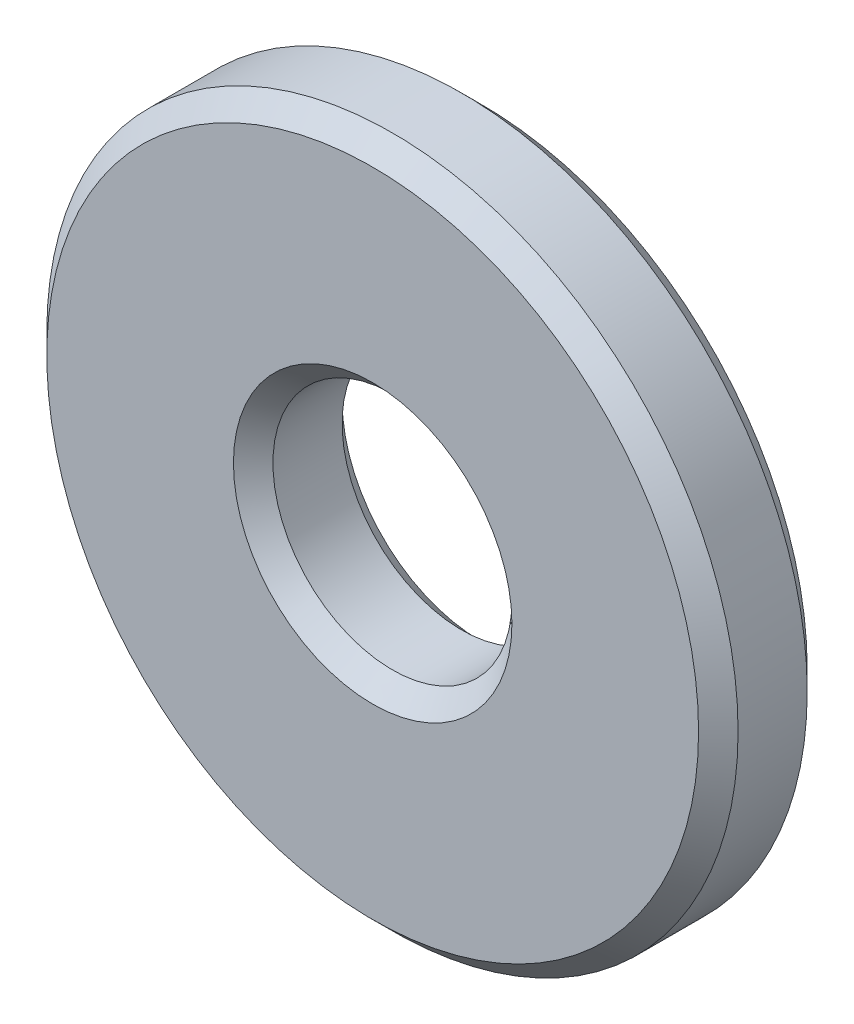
ISO-10303-21;
HEADER;
FILE_DESCRIPTION(('STEP AP214'),'2;1');
FILE_NAME('part.step','',(''),(''),'','','');
FILE_SCHEMA(('AUTOMOTIVE_DESIGN { 1 0 10303 214 1 1 1 1 }'));
ENDSEC;
DATA;
#1=APPLICATION_CONTEXT('core data for automotive mechanical design processes');
#2=APPLICATION_PROTOCOL_DEFINITION('international standard','automotive_design',2000,#1);
#3=PRODUCT_CONTEXT('',#1,'mechanical');
#4=PRODUCT('Part','Part','',(#3));
#5=PRODUCT_RELATED_PRODUCT_CATEGORY('part','',(#4));
#6=PRODUCT_DEFINITION_FORMATION('','',#4);
#7=PRODUCT_DEFINITION_CONTEXT('part definition',#1,'design');
#8=PRODUCT_DEFINITION('design','',#6,#7);
#9=PRODUCT_DEFINITION_SHAPE('','',#8);
#10=(LENGTH_UNIT() NAMED_UNIT(*) SI_UNIT(.MILLI.,.METRE.));
#11=(NAMED_UNIT(*) PLANE_ANGLE_UNIT() SI_UNIT($,.RADIAN.));
#12=(NAMED_UNIT(*) SI_UNIT($,.STERADIAN.) SOLID_ANGLE_UNIT());
#13=UNCERTAINTY_MEASURE_WITH_UNIT(LENGTH_MEASURE(1.E-05),#10,'distance_accuracy_value','');
#14=(GEOMETRIC_REPRESENTATION_CONTEXT(3) GLOBAL_UNCERTAINTY_ASSIGNED_CONTEXT((#13)) GLOBAL_UNIT_ASSIGNED_CONTEXT((#10,
#11,#12)) REPRESENTATION_CONTEXT('',''));
#15=CARTESIAN_POINT('',(0.,0.,0.));
#16=DIRECTION('',(0.,0.,1.));
#17=DIRECTION('',(1.,0.,0.));
#18=AXIS2_PLACEMENT_3D('',#15,#16,#17);
#19=CARTESIAN_POINT('',(-3.33066907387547E-13,-6.10622663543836E-13,5.50000000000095));
#20=DIRECTION('',(0.,0.,1.));
#21=DIRECTION('',(1.,0.,0.));
#22=AXIS2_PLACEMENT_3D('',#19,#20,#21);
#23=PLANE('',#22);
#24=CARTESIAN_POINT('',(-3.33066907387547E-13,-6.10622663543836E-13,5.50000000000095));
#25=DIRECTION('',(0.,0.,1.));
#26=DIRECTION('',(1.,0.,0.));
#27=AXIS2_PLACEMENT_3D('',#24,#25,#26);
#28=CIRCLE('',#27,7.05000000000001);
#29=CARTESIAN_POINT('',(7.0499999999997,-6.03562623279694E-13,5.50000000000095));
#30=VERTEX_POINT('',#29);
#31=EDGE_CURVE('E10',#30,#30,#28,.F.);
#32=ORIENTED_EDGE('',*,*,#31,.T.);
#33=EDGE_LOOP('',(#32));
#34=FACE_BOUND('',#33,.T.);
#35=CARTESIAN_POINT('',(-3.33066907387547E-13,-6.10622663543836E-13,5.50000000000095));
#36=DIRECTION('',(0.,0.,1.));
#37=DIRECTION('',(1.,0.,0.));
#38=AXIS2_PLACEMENT_3D('',#35,#36,#37);
#39=CIRCLE('',#38,16.5);
#40=CARTESIAN_POINT('',(16.4999999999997,-5.9409916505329E-13,5.50000000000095));
#41=VERTEX_POINT('',#40);
#42=EDGE_CURVE('E33',#41,#41,#39,.T.);
#43=ORIENTED_EDGE('',*,*,#42,.T.);
#44=EDGE_LOOP('',(#43));
#45=FACE_BOUND('',#44,.T.);
#46=ADVANCED_FACE('F26',(#34,#45),#23,.T.);
#47=CARTESIAN_POINT('',(0.,0.,0.));
#48=DIRECTION('',(0.,0.,1.));
#49=DIRECTION('',(1.,0.,0.));
#50=AXIS2_PLACEMENT_3D('',#47,#48,#49);
#51=PLANE('',#50);
#52=CARTESIAN_POINT('',(0.,0.,0.));
#53=DIRECTION('',(0.,0.,1.));
#54=DIRECTION('',(1.,0.,0.));
#55=AXIS2_PLACEMENT_3D('',#52,#53,#54);
#56=CIRCLE('',#55,7.05000000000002);
#57=CARTESIAN_POINT('',(7.05000000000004,0.,0.));
#58=VERTEX_POINT('',#57);
#59=EDGE_CURVE('E52',#58,#58,#56,.T.);
#60=ORIENTED_EDGE('',*,*,#59,.T.);
#61=EDGE_LOOP('',(#60));
#62=FACE_BOUND('',#61,.T.);
#63=CARTESIAN_POINT('',(0.,0.,0.));
#64=DIRECTION('',(0.,0.,1.));
#65=DIRECTION('',(1.,0.,0.));
#66=AXIS2_PLACEMENT_3D('',#63,#64,#65);
#67=CIRCLE('',#66,16.5);
#68=CARTESIAN_POINT('',(16.5000000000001,0.,0.));
#69=VERTEX_POINT('',#68);
#70=EDGE_CURVE('E55',#69,#69,#67,.F.);
#71=ORIENTED_EDGE('',*,*,#70,.T.);
#72=EDGE_LOOP('',(#71));
#73=FACE_BOUND('',#72,.T.);
#74=ADVANCED_FACE('F59',(#62,#73),#51,.F.);
#75=CARTESIAN_POINT('',(-3.33066907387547E-13,-6.10622663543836E-13,5.50000000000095));
#76=DIRECTION('',(0.,0.,-1.));
#77=DIRECTION('',(-1.,0.,0.));
#78=AXIS2_PLACEMENT_3D('',#75,#76,#77);
#79=CYLINDRICAL_SURFACE('',#78,17.5);
#80=CARTESIAN_POINT('',(0.,-6.10622663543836E-13,1.00000000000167));
#81=DIRECTION('',(0.,0.,1.));
#82=DIRECTION('',(1.,0.,0.));
#83=AXIS2_PLACEMENT_3D('',#80,#81,#82);
#84=CIRCLE('',#83,17.5);
#85=CARTESIAN_POINT('',(17.5,-5.93097740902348E-13,1.00000000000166));
#86=VERTEX_POINT('',#85);
#87=EDGE_CURVE('E37',#86,#86,#84,.T.);
#88=ORIENTED_EDGE('',*,*,#87,.T.);
#89=EDGE_LOOP('',(#88));
#90=FACE_BOUND('',#89,.T.);
#91=CARTESIAN_POINT('',(-1.2490009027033E-12,-5.55111512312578E-13,4.50000000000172));
#92=DIRECTION('',(0.,0.,1.));
#93=DIRECTION('',(1.,0.,0.));
#94=AXIS2_PLACEMENT_3D('',#91,#92,#93);
#95=CIRCLE('',#94,17.5);
#96=CARTESIAN_POINT('',(17.4999999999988,-5.3758658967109E-13,4.50000000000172));
#97=VERTEX_POINT('',#96);
#98=EDGE_CURVE('E41',#97,#97,#95,.F.);
#99=ORIENTED_EDGE('',*,*,#98,.T.);
#100=EDGE_LOOP('',(#99));
#101=FACE_BOUND('',#100,.T.);
#102=ADVANCED_FACE('F28',(#90,#101),#79,.T.);
#103=CARTESIAN_POINT('',(-3.33066907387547E-13,-6.10622663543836E-13,5.50000000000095));
#104=DIRECTION('',(0.,0.,-1.));
#105=DIRECTION('',(-1.,0.,0.));
#106=AXIS2_PLACEMENT_3D('',#103,#104,#105);
#107=CYLINDRICAL_SURFACE('',#106,6.05);
#108=CARTESIAN_POINT('',(0.,-6.10622663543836E-13,1.00000000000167));
#109=DIRECTION('',(0.,0.,1.));
#110=DIRECTION('',(1.,0.,0.));
#111=AXIS2_PLACEMENT_3D('',#108,#109,#110);
#112=CIRCLE('',#111,6.05);
#113=CARTESIAN_POINT('',(6.04999999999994,-6.04564047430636E-13,1.00000000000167));
#114=VERTEX_POINT('',#113);
#115=EDGE_CURVE('E46',#114,#114,#112,.F.);
#116=ORIENTED_EDGE('',*,*,#115,.T.);
#117=EDGE_LOOP('',(#116));
#118=FACE_BOUND('',#117,.T.);
#119=CARTESIAN_POINT('',(-1.2490009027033E-12,-5.55111512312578E-13,4.50000000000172));
#120=DIRECTION('',(0.,0.,1.));
#121=DIRECTION('',(1.,0.,0.));
#122=AXIS2_PLACEMENT_3D('',#119,#120,#121);
#123=CIRCLE('',#122,6.05);
#124=CARTESIAN_POINT('',(6.04999999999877,-5.49052896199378E-13,4.50000000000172));
#125=VERTEX_POINT('',#124);
#126=EDGE_CURVE('E49',#125,#125,#123,.T.);
#127=ORIENTED_EDGE('',*,*,#126,.T.);
#128=EDGE_LOOP('',(#127));
#129=FACE_BOUND('',#128,.T.);
#130=ADVANCED_FACE('F71',(#118,#129),#107,.F.);
#131=CARTESIAN_POINT('',(0.,0.,0.));
#132=DIRECTION('',(0.,0.,-1.));
#133=DIRECTION('',(-1.,0.,0.));
#134=AXIS2_PLACEMENT_3D('',#131,#132,#133);
#135=CONICAL_SURFACE('',#134,7.05000000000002,0.785398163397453);
#136=ORIENTED_EDGE('',*,*,#115,.F.);
#137=EDGE_LOOP('',(#136));
#138=FACE_BOUND('',#137,.T.);
#139=ORIENTED_EDGE('',*,*,#59,.F.);
#140=EDGE_LOOP('',(#139));
#141=FACE_BOUND('',#140,.T.);
#142=ADVANCED_FACE('F65',(#138,#141),#135,.F.);
#143=CARTESIAN_POINT('',(0.,-6.10622663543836E-13,1.00000000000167));
#144=DIRECTION('',(0.,0.,1.));
#145=DIRECTION('',(1.,0.,0.));
#146=AXIS2_PLACEMENT_3D('',#143,#144,#145);
#147=CONICAL_SURFACE('',#146,17.5,0.785398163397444);
#148=ORIENTED_EDGE('',*,*,#70,.F.);
#149=EDGE_LOOP('',(#148));
#150=FACE_BOUND('',#149,.T.);
#151=ORIENTED_EDGE('',*,*,#87,.F.);
#152=EDGE_LOOP('',(#151));
#153=FACE_BOUND('',#152,.T.);
#154=ADVANCED_FACE('F61',(#150,#153),#147,.T.);
#155=CARTESIAN_POINT('',(-1.2490009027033E-12,-5.55111512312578E-13,4.50000000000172));
#156=DIRECTION('',(0.,0.,1.));
#157=DIRECTION('',(1.,0.,0.));
#158=AXIS2_PLACEMENT_3D('',#155,#156,#157);
#159=CONICAL_SURFACE('',#158,6.05,0.785398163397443);
#160=ORIENTED_EDGE('',*,*,#31,.F.);
#161=EDGE_LOOP('',(#160));
#162=FACE_BOUND('',#161,.T.);
#163=ORIENTED_EDGE('',*,*,#126,.F.);
#164=EDGE_LOOP('',(#163));
#165=FACE_BOUND('',#164,.T.);
#166=ADVANCED_FACE('F64',(#162,#165),#159,.F.);
#167=CARTESIAN_POINT('',(-3.33066907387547E-13,-6.10622663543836E-13,5.50000000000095));
#168=DIRECTION('',(0.,0.,-1.));
#169=DIRECTION('',(-1.,0.,0.));
#170=AXIS2_PLACEMENT_3D('',#167,#168,#169);
#171=CONICAL_SURFACE('',#170,16.5,0.785398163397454);
#172=ORIENTED_EDGE('',*,*,#98,.F.);
#173=EDGE_LOOP('',(#172));
#174=FACE_BOUND('',#173,.T.);
#175=ORIENTED_EDGE('',*,*,#42,.F.);
#176=EDGE_LOOP('',(#175));
#177=FACE_BOUND('',#176,.T.);
#178=ADVANCED_FACE('F74',(#174,#177),#171,.T.);
#179=CLOSED_SHELL('',(#46,#74,#102,#130,#142,#154,#166,#178));
#180=MANIFOLD_SOLID_BREP('B2',#179);
#181=ADVANCED_BREP_SHAPE_REPRESENTATION('',(#18,#180),#14);
#182=SHAPE_DEFINITION_REPRESENTATION(#9,#181);
ENDSEC;
END-ISO-10303-21;
